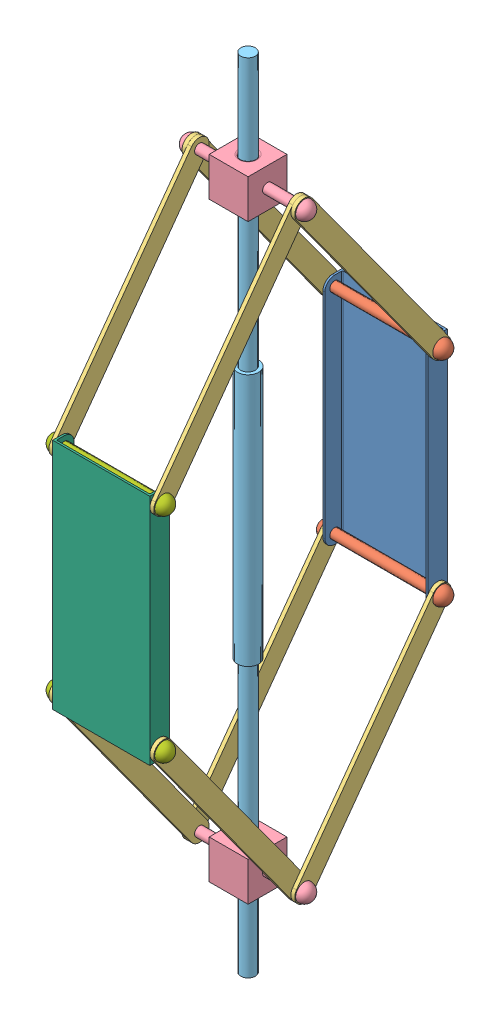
SolidWorks assembly Lab6 Assembly 1.SLDASM, configuration Default (file format 14000). Lengths in mm.
Overall size (85.09 520.7 196.9).
17 component instances, 7 part files, 40 mates.
Components (placement in the parent):
- Lab6 Lower Base-1: Lab6 Lower Base.SLDPRT [Default] at origin size (68.58 152.4 12.7)
- Lab6 Long Pin-1: Lab6 Long Pin.SLDPRT [Default] at (-34.29 5.4931 9.4072) x (1 0 0) z (0 -0.962895 -0.269876) size (85.09 11.43 11.43)
- Lab6 Link-1: Lab6 Link.SLDPRT [Default] at (2.54 -113.2118 101.0657) x (0 0.809017 -0.587785) z (-1 0 0) size (165.1 12.7 2.54)
- Lab6 Link-2: Lab6 Link.SLDPRT [Default] at (-68.58 2.6176 1.2127) x (0 -0.809017 0.587785) z (-1 0 0) size (165.1 12.7 2.54)
- Lab6 Pivot-1: Lab6 Pivot.SLDPRT [Default] at (-34.29 -116.9442 83.2285) x (1 0 0) z (0 -1 0) size (85.09 25.4 25.4)
- Lab6 Long Pin-2: Lab6 Long Pin.SLDPRT [Default] at (-34.29 144.304 9.0018) x (1 0 0) z (0 -0.835206 -0.549937) size (85.09 11.43 11.43)
- Lab6 Link-3: Lab6 Link.SLDPRT [Default] at (2.54 273.0766 90.7912) x (0 -0.809017 -0.587785) z (-1 0 0) size (165.1 12.7 2.54)
- Lab6 Link-4: Lab6 Link.SLDPRT [Default] at (-68.58 273.0766 90.7912) x (0 -0.809017 -0.587785) z (-1 0 0) size (165.1 12.7 2.54)
- Lab6 Pivot-2: Lab6 Pivot.SLDPRT [Default] at (-34.29 269.3442 83.2285) x (1 0 0) z (0 -1 0) size (85.09 25.4 25.4)
- Lab6 Shaft-1: Lab6 Shaft.SLDPRT [Default] at (-34.29 339.9953 95.9285) x (0.640285 0 0.768138) z (0 1 0) size (13.97 13.97 520.7)
- Lab6 Link-5: Lab6 Link.SLDPRT [Default] at (-66.04 10.0824 180.3697) x (0 -0.809017 -0.587785) z (-1 0 0) size (165.1 12.7 2.54)
- Lab6 Link-7: Lab6 Link.SLDPRT [Default] at (0 10.0824 180.3697) x (0 -0.809017 -0.587785) z (-1 0 0) size (165.1 12.7 2.54)
- Lab6 Link-8: Lab6 Link.SLDPRT [Default] at (-66.04 149.7824 190.6442) x (0 0.809017 -0.587785) z (-1 0 0) size (165.1 12.7 2.54)
- Lab6 Link-9: Lab6 Link.SLDPRT [Default] at (0 149.7824 190.6442) x (0 0.809017 -0.587785) z (-1 0 0) size (165.1 12.7 2.54)
- Lab6 Upper Base-1: Lab6 Upper Base.SLDPRT [Default] at (-2.54 152.4 191.8569) x (1 0 0) z (0 0 -1) size (63.5 152.4 12.7)
- Lab6 Short Pin-1: Lab6 Short Pin.SLDPRT [Default] at (-34.29 9.525 185.5069) size (80.01 11.43 11.43)
- Lab6 Short Pin-3: Lab6 Short Pin.SLDPRT [Default] at (-34.29 149.225 185.5069) size (80.01 11.43 11.43)
Mates (geometry in assembly coordinates):
- Concentric1: concentric anti-aligned: cylinder of Lab6 Lower Base-1 through (-1.27 6.35 6.35) axis (1 0 0) radius 3.175; cylinder of Lab6 Long Pin-1 through (-76.835 6.35 6.35) axis (-1 0 0) radius 3.175
- Concentric2: concentric anti-aligned: cylinder of Lab6 Long Pin-1 through (-76.835 6.35 6.35) axis (-1 0 0) radius 3.175; cylinder of Lab6 Link-1 through (0 6.35 6.35) axis (1 0 0) radius 3.175
- Coincident1: coincident anti-aligned: plane of Lab6 Lower Base-1 through (0 0 1.27) normal (1 0 0); plane of Lab6 Link-1 through (0 -116.9442 95.9285) normal (-1 0 0)
- Coincident2: coincident anti-aligned: plane of Lab6 Long Pin-1 through (2.54 5.4931 9.4072) normal (-1 0 0); plane of Lab6 Link-1 through (2.54 -116.9442 95.9285) normal (1 0 0)
- Concentric3: concentric anti-aligned: cylinder of Lab6 Long Pin-1 through (-76.835 6.35 6.35) axis (-1 0 0) radius 3.175; cylinder of Lab6 Link-2 through (-71.12 6.35 6.35) axis (1 0 0) radius 3.175
- Coincident3: coincident anti-aligned: plane of Lab6 Lower Base-1 through (-68.58 0 1.27) normal (-1 0 0); plane of Lab6 Link-2 through (-68.58 6.35 6.35) normal (1 0 0)
- Concentric4: concentric aligned: cylinder of Lab6 Link-1 through (0 -116.9442 95.9285) axis (1 0 0) radius 3.175; cylinder of Lab6 Link-2 through (-71.12 -116.9442 95.9285) axis (1 0 0) radius 3.175
- Concentric5: concentric anti-aligned: cylinder of Lab6 Link-1 through (0 -116.9442 95.9285) axis (1 0 0) radius 3.175; cylinder of Lab6 Pivot-1 through (-76.835 -116.9442 95.9285) axis (-1 0 0) radius 3.175
- Coincident5: coincident anti-aligned: plane of Lab6 Link-2 through (-71.12 6.35 6.35) normal (-1 0 0); plane of Lab6 Pivot-1 through (-71.12 -116.9442 99.1035) normal (1 0 0)
- Parallel1: parallel anti-aligned: plane of Lab6 Lower Base-1 through (0 0 1.27) normal (0 0 1); plane of Lab6 Pivot-1 through (-46.99 -129.6442 83.2285) normal (0 0 -1)
- Concentric6: concentric aligned: cylinder of Lab6 Lower Base-1 through (-67.31 146.05 6.35) axis (-1 0 0) radius 3.175; cylinder of Lab6 Long Pin-2 through (-76.835 146.05 6.35) axis (-1 0 0) radius 3.175
- Concentric7: concentric anti-aligned: cylinder of Lab6 Long Pin-2 through (-76.835 146.05 6.35) axis (-1 0 0) radius 3.175; cylinder of Lab6 Link-3 through (0 146.05 6.35) axis (1 0 0) radius 3.175
- Coincident8: coincident anti-aligned: plane of Lab6 Lower Base-1 through (0 0 1.27) normal (1 0 0); plane of Lab6 Link-3 through (0 269.3442 95.9285) normal (-1 0 0)
- Coincident9: coincident anti-aligned: plane of Lab6 Long Pin-2 through (2.54 144.304 9.0018) normal (-1 0 0); plane of Lab6 Link-3 through (2.54 269.3442 95.9285) normal (1 0 0)
- Concentric8: concentric anti-aligned: cylinder of Lab6 Long Pin-2 through (-76.835 146.05 6.35) axis (-1 0 0) radius 3.175; cylinder of Lab6 Link-4 through (-71.12 146.05 6.35) axis (1 0 0) radius 3.175
- Coincident10: coincident anti-aligned: plane of Lab6 Long Pin-2 through (-71.12 144.304 9.0018) normal (1 0 0); plane of Lab6 Link-4 through (-71.12 269.3442 95.9285) normal (-1 0 0)
- Concentric9: concentric aligned: cylinder of Lab6 Link-3 through (0 269.3442 95.9285) axis (1 0 0) radius 3.175; cylinder of Lab6 Link-4 through (-71.12 269.3442 95.9285) axis (1 0 0) radius 3.175
- Concentric10: concentric anti-aligned: cylinder of Lab6 Link-3 through (0 269.3442 95.9285) axis (1 0 0) radius 3.175; cylinder of Lab6 Pivot-2 through (-76.835 269.3442 95.9285) axis (-1 0 0) radius 3.175
- Coincident11: coincident anti-aligned: plane of Lab6 Link-3 through (2.54 269.3442 95.9285) normal (1 0 0); plane of Lab6 Pivot-2 through (2.54 269.3442 99.1035) normal (-1 0 0)
- Parallel2: parallel anti-aligned: plane of Lab6 Lower Base-1 through (0 0 1.27) normal (0 0 1); plane of Lab6 Pivot-2 through (-46.99 256.6442 83.2285) normal (0 0 -1)
- Concentric11: concentric aligned: cylinder of Lab6 Pivot-1 through (-34.29 -104.2442 95.9285) axis (0 -1 0) radius 4.7625; cylinder of Lab6 Pivot-2 through (-34.29 282.0442 95.9285) axis (0 -1 0) radius 4.7625
- Concentric12: concentric anti-aligned: cylinder of Lab6 Pivot-1 through (-34.29 -104.2442 95.9285) axis (0 -1 0) radius 4.7625; cylinder of Lab6 Shaft-1 through (-34.29 -180.7047 95.9285) axis (0 1 0) radius 4.7625
- Concentric13: concentric anti-aligned: cylinder of Lab6 Pivot-1 through (-76.835 -116.9442 95.9285) axis (-1 0 0) radius 3.175; cylinder of Lab6 Link-5 through (-68.58 -116.9442 95.9285) axis (1 0 0) radius 3.175
- Coincident13: coincident anti-aligned: plane of Lab6 Link-2 through (-68.58 6.35 6.35) normal (1 0 0); plane of Lab6 Link-5 through (-68.58 6.35 185.5069) normal (-1 0 0)
- Angle1: planar angle = 2.513274 rad anti-aligned: cylinder of Lab6 Shaft-1 through (-34.29 -180.7047 95.9285) axis (0 1 0) radius 4.7625; line of Lab6 Link-1 through (2.54 -113.2118 101.0657) axis (0 0.809017 -0.587785)
- Concentric14: concentric anti-aligned: cylinder of Lab6 Pivot-1 through (-76.835 -116.9442 95.9285) axis (-1 0 0) radius 3.175; cylinder of Lab6 Link-7 through (-2.54 -116.9442 95.9285) axis (1 0 0) radius 3.175
- Coincident15: coincident anti-aligned: plane of Lab6 Link-1 through (0 -116.9442 95.9285) normal (-1 0 0); plane of Lab6 Link-7 through (0 6.35 185.5069) normal (1 0 0)
- Concentric15: concentric aligned: cylinder of Lab6 Link-5 through (-68.58 6.35 185.5069) axis (1 0 0) radius 3.175; cylinder of Lab6 Link-7 through (-2.54 6.35 185.5069) axis (1 0 0) radius 3.175
- Angle2: planar angle = 0.628319 rad anti-aligned: line of Lab6 Link-7 through (0 10.0824 180.3697) axis (0 -0.809017 -0.587785); cylinder of Lab6 Shaft-1 through (-34.29 -180.7047 95.9285) axis (0 1 0) radius 4.7625
- Concentric16: concentric anti-aligned: cylinder of Lab6 Pivot-2 through (-76.835 269.3442 95.9285) axis (-1 0 0) radius 3.175; cylinder of Lab6 Link-9 through (-2.54 269.3442 95.9285) axis (1 0 0) radius 3.175
- Coincident17: coincident anti-aligned: plane of Lab6 Link-3 through (0 269.3442 95.9285) normal (-1 0 0); plane of Lab6 Link-9 through (0 146.05 185.5069) normal (1 0 0)
- Concentric17: concentric anti-aligned: cylinder of Lab6 Pivot-2 through (-76.835 269.3442 95.9285) axis (-1 0 0) radius 3.175; cylinder of Lab6 Link-8 through (-68.58 269.3442 95.9285) axis (1 0 0) radius 3.175
- Coincident18: coincident anti-aligned: plane of Lab6 Link-4 through (-68.58 269.3442 95.9285) normal (1 0 0); plane of Lab6 Link-8 through (-68.58 146.05 185.5069) normal (-1 0 0)
- Concentric18: concentric aligned: cylinder of Lab6 Link-8 through (-68.58 146.05 185.5069) axis (1 0 0) radius 3.175; cylinder of Lab6 Link-9 through (-2.54 146.05 185.5069) axis (1 0 0) radius 3.175
- Concentric19: concentric aligned: cylinder of Lab6 Link-7 through (-2.54 6.35 185.5069) axis (1 0 0) radius 3.175; cylinder of Lab6 Upper Base-1 through (-3.81 6.35 185.5069) axis (1 0 0) radius 3.175
- Concentric20: concentric aligned: cylinder of Lab6 Link-9 through (-2.54 146.05 185.5069) axis (1 0 0) radius 3.175; cylinder of Lab6 Upper Base-1 through (-3.81 146.05 185.5069) axis (1 0 0) radius 3.175
- Concentric21: concentric anti-aligned: cylinder of Lab6 Link-7 through (-2.54 6.35 185.5069) axis (1 0 0) radius 3.175; cylinder of Lab6 Short Pin-1 through (-74.295 6.35 185.5069) axis (-1 0 0) radius 3.175
- Coincident19: coincident anti-aligned: plane of Lab6 Link-7 through (0 6.35 185.5069) normal (1 0 0); plane of Lab6 Short Pin-1 through (0 9.525 185.5069) normal (-1 0 0)
- Concentric22: concentric: cylinder of Lab6 Link-9 through (-2.54 146.05 185.5069) axis (1 0 0) radius 3.175; cylinder of Lab6 Short Pin-3 through (-74.295 146.05 185.5069) axis (-1 0 0) radius 3.175
- Coincident20: coincident anti-aligned: plane of Lab6 Link-9 through (0 146.05 185.5069) normal (1 0 0); plane of Lab6 Short Pin-3 through (0 149.225 185.5069) normal (-1 0 0)
